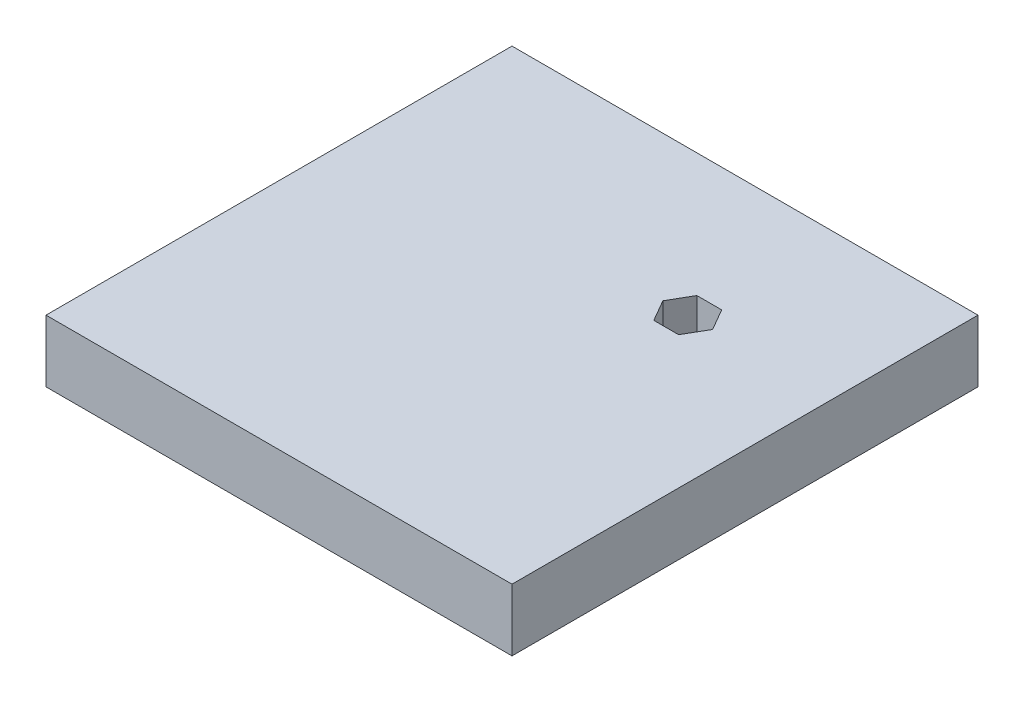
ISO-10303-21;
HEADER;
FILE_DESCRIPTION(('STEP AP214'),'2;1');
FILE_NAME('part.step','',(''),(''),'','','');
FILE_SCHEMA(('AUTOMOTIVE_DESIGN { 1 0 10303 214 1 1 1 1 }'));
ENDSEC;
DATA;
#1=APPLICATION_CONTEXT('core data for automotive mechanical design processes');
#2=APPLICATION_PROTOCOL_DEFINITION('international standard','automotive_design',2000,#1);
#3=PRODUCT_CONTEXT('',#1,'mechanical');
#4=PRODUCT('Part','Part','',(#3));
#5=PRODUCT_RELATED_PRODUCT_CATEGORY('part','',(#4));
#6=PRODUCT_DEFINITION_FORMATION('','',#4);
#7=PRODUCT_DEFINITION_CONTEXT('part definition',#1,'design');
#8=PRODUCT_DEFINITION('design','',#6,#7);
#9=PRODUCT_DEFINITION_SHAPE('','',#8);
#10=(LENGTH_UNIT() NAMED_UNIT(*) SI_UNIT(.MILLI.,.METRE.));
#11=(NAMED_UNIT(*) PLANE_ANGLE_UNIT() SI_UNIT($,.RADIAN.));
#12=(NAMED_UNIT(*) SI_UNIT($,.STERADIAN.) SOLID_ANGLE_UNIT());
#13=UNCERTAINTY_MEASURE_WITH_UNIT(LENGTH_MEASURE(1.E-05),#10,'distance_accuracy_value','');
#14=(GEOMETRIC_REPRESENTATION_CONTEXT(3) GLOBAL_UNCERTAINTY_ASSIGNED_CONTEXT((#13)) GLOBAL_UNIT_ASSIGNED_CONTEXT((#10,
#11,#12)) REPRESENTATION_CONTEXT('',''));
#15=CARTESIAN_POINT('',(0.,0.,0.));
#16=DIRECTION('',(0.,0.,1.));
#17=DIRECTION('',(1.,0.,0.));
#18=AXIS2_PLACEMENT_3D('',#15,#16,#17);
#19=CARTESIAN_POINT('',(-75.,20.,-75.));
#20=DIRECTION('',(1.,0.,0.));
#21=DIRECTION('',(0.,0.,-1.));
#22=AXIS2_PLACEMENT_3D('',#19,#20,#21);
#23=PLANE('',#22);
#24=DIRECTION('',(0.,0.,1.));
#25=VECTOR('',#24,1.);
#26=CARTESIAN_POINT('',(-75.,0.,-75.));
#27=LINE('',#26,#25);
#28=CARTESIAN_POINT('',(-75.,0.,-75.));
#29=VERTEX_POINT('',#28);
#30=CARTESIAN_POINT('',(-75.,0.,75.));
#31=VERTEX_POINT('',#30);
#32=EDGE_CURVE('E155',#29,#31,#27,.T.);
#33=ORIENTED_EDGE('',*,*,#32,.T.);
#34=DIRECTION('',(0.,-1.,0.));
#35=VECTOR('',#34,1.);
#36=CARTESIAN_POINT('',(-75.,20.,75.));
#37=LINE('',#36,#35);
#38=CARTESIAN_POINT('',(-75.,20.,75.));
#39=VERTEX_POINT('',#38);
#40=EDGE_CURVE('E11',#39,#31,#37,.T.);
#41=ORIENTED_EDGE('',*,*,#40,.F.);
#42=DIRECTION('',(0.,0.,1.));
#43=VECTOR('',#42,1.);
#44=CARTESIAN_POINT('',(-75.,20.,-75.));
#45=LINE('',#44,#43);
#46=CARTESIAN_POINT('',(-75.,20.,-75.));
#47=VERTEX_POINT('',#46);
#48=EDGE_CURVE('E170',#47,#39,#45,.T.);
#49=ORIENTED_EDGE('',*,*,#48,.F.);
#50=DIRECTION('',(0.,-1.,0.));
#51=VECTOR('',#50,1.);
#52=CARTESIAN_POINT('',(-75.,20.,-75.));
#53=LINE('',#52,#51);
#54=EDGE_CURVE('E179',#47,#29,#53,.T.);
#55=ORIENTED_EDGE('',*,*,#54,.T.);
#56=EDGE_LOOP('',(#33,#41,#49,#55));
#57=FACE_BOUND('',#56,.T.);
#58=ADVANCED_FACE('F32',(#57),#23,.F.);
#59=CARTESIAN_POINT('',(-75.,20.,75.));
#60=DIRECTION('',(0.,0.,-1.));
#61=DIRECTION('',(-1.,0.,0.));
#62=AXIS2_PLACEMENT_3D('',#59,#60,#61);
#63=PLANE('',#62);
#64=DIRECTION('',(1.,0.,0.));
#65=VECTOR('',#64,1.);
#66=CARTESIAN_POINT('',(-75.,0.,75.));
#67=LINE('',#66,#65);
#68=CARTESIAN_POINT('',(75.,0.,75.));
#69=VERTEX_POINT('',#68);
#70=EDGE_CURVE('E164',#31,#69,#67,.T.);
#71=ORIENTED_EDGE('',*,*,#70,.T.);
#72=DIRECTION('',(0.,-1.,0.));
#73=VECTOR('',#72,1.);
#74=CARTESIAN_POINT('',(75.,20.,75.));
#75=LINE('',#74,#73);
#76=CARTESIAN_POINT('',(75.,20.,75.));
#77=VERTEX_POINT('',#76);
#78=EDGE_CURVE('E39',#77,#69,#75,.T.);
#79=ORIENTED_EDGE('',*,*,#78,.F.);
#80=DIRECTION('',(1.,0.,0.));
#81=VECTOR('',#80,1.);
#82=CARTESIAN_POINT('',(-75.,20.,75.));
#83=LINE('',#82,#81);
#84=EDGE_CURVE('E173',#39,#77,#83,.T.);
#85=ORIENTED_EDGE('',*,*,#84,.F.);
#86=ORIENTED_EDGE('',*,*,#40,.T.);
#87=EDGE_LOOP('',(#71,#79,#85,#86));
#88=FACE_BOUND('',#87,.T.);
#89=ADVANCED_FACE('F203',(#88),#63,.F.);
#90=CARTESIAN_POINT('',(75.,20.,-75.));
#91=DIRECTION('',(-1.,0.,0.));
#92=DIRECTION('',(0.,0.,1.));
#93=AXIS2_PLACEMENT_3D('',#90,#91,#92);
#94=PLANE('',#93);
#95=DIRECTION('',(0.,0.,-1.));
#96=VECTOR('',#95,1.);
#97=CARTESIAN_POINT('',(75.,0.,-75.));
#98=LINE('',#97,#96);
#99=CARTESIAN_POINT('',(75.,0.,-75.));
#100=VERTEX_POINT('',#99);
#101=EDGE_CURVE('E166',#69,#100,#98,.T.);
#102=ORIENTED_EDGE('',*,*,#101,.T.);
#103=DIRECTION('',(0.,-1.,0.));
#104=VECTOR('',#103,1.);
#105=CARTESIAN_POINT('',(75.,20.,-75.));
#106=LINE('',#105,#104);
#107=CARTESIAN_POINT('',(75.,20.,-75.));
#108=VERTEX_POINT('',#107);
#109=EDGE_CURVE('E182',#108,#100,#106,.T.);
#110=ORIENTED_EDGE('',*,*,#109,.F.);
#111=DIRECTION('',(0.,0.,-1.));
#112=VECTOR('',#111,1.);
#113=CARTESIAN_POINT('',(75.,20.,-75.));
#114=LINE('',#113,#112);
#115=EDGE_CURVE('E175',#77,#108,#114,.T.);
#116=ORIENTED_EDGE('',*,*,#115,.F.);
#117=ORIENTED_EDGE('',*,*,#78,.T.);
#118=EDGE_LOOP('',(#102,#110,#116,#117));
#119=FACE_BOUND('',#118,.T.);
#120=ADVANCED_FACE('F189',(#119),#94,.F.);
#121=CARTESIAN_POINT('',(-75.,20.,-75.));
#122=DIRECTION('',(0.,0.,1.));
#123=DIRECTION('',(1.,0.,0.));
#124=AXIS2_PLACEMENT_3D('',#121,#122,#123);
#125=PLANE('',#124);
#126=DIRECTION('',(-1.,0.,0.));
#127=VECTOR('',#126,1.);
#128=CARTESIAN_POINT('',(-75.,0.,-75.));
#129=LINE('',#128,#127);
#130=EDGE_CURVE('E168',#100,#29,#129,.T.);
#131=ORIENTED_EDGE('',*,*,#130,.T.);
#132=ORIENTED_EDGE('',*,*,#54,.F.);
#133=DIRECTION('',(-1.,0.,0.));
#134=VECTOR('',#133,1.);
#135=CARTESIAN_POINT('',(-75.,20.,-75.));
#136=LINE('',#135,#134);
#137=EDGE_CURVE('E177',#108,#47,#136,.T.);
#138=ORIENTED_EDGE('',*,*,#137,.F.);
#139=ORIENTED_EDGE('',*,*,#109,.T.);
#140=EDGE_LOOP('',(#131,#132,#138,#139));
#141=FACE_BOUND('',#140,.T.);
#142=ADVANCED_FACE('F198',(#141),#125,.F.);
#143=CARTESIAN_POINT('',(-75.,20.,75.));
#144=DIRECTION('',(0.,1.,0.));
#145=DIRECTION('',(0.,0.,1.));
#146=AXIS2_PLACEMENT_3D('',#143,#144,#145);
#147=PLANE('',#146);
#148=DIRECTION('',(0.5,0.,-0.866025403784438));
#149=VECTOR('',#148,1.);
#150=CARTESIAN_POINT('',(32.2842712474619,20.,-21.3560680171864));
#151=LINE('',#150,#149);
#152=CARTESIAN_POINT('',(32.2842712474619,20.,-21.3560680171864));
#153=VERTEX_POINT('',#152);
#154=CARTESIAN_POINT('',(36.2842712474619,20.,-28.284271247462));
#155=VERTEX_POINT('',#154);
#156=EDGE_CURVE('E46',#153,#155,#151,.T.);
#157=ORIENTED_EDGE('',*,*,#156,.F.);
#158=DIRECTION('',(1.,0.,0.));
#159=VECTOR('',#158,1.);
#160=CARTESIAN_POINT('',(24.2842712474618,20.,-21.3560680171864));
#161=LINE('',#160,#159);
#162=CARTESIAN_POINT('',(24.2842712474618,20.,-21.3560680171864));
#163=VERTEX_POINT('',#162);
#164=EDGE_CURVE('E135',#163,#153,#161,.T.);
#165=ORIENTED_EDGE('',*,*,#164,.F.);
#166=DIRECTION('',(0.5,0.,0.866025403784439));
#167=VECTOR('',#166,1.);
#168=CARTESIAN_POINT('',(20.2842712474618,20.,-28.284271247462));
#169=LINE('',#168,#167);
#170=CARTESIAN_POINT('',(20.2842712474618,20.,-28.284271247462));
#171=VERTEX_POINT('',#170);
#172=EDGE_CURVE('E129',#171,#163,#169,.T.);
#173=ORIENTED_EDGE('',*,*,#172,.F.);
#174=DIRECTION('',(-0.5,0.,0.866025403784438));
#175=VECTOR('',#174,1.);
#176=CARTESIAN_POINT('',(24.2842712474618,20.,-35.2124744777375));
#177=LINE('',#176,#175);
#178=CARTESIAN_POINT('',(24.2842712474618,20.,-35.2124744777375));
#179=VERTEX_POINT('',#178);
#180=EDGE_CURVE('E127',#179,#171,#177,.T.);
#181=ORIENTED_EDGE('',*,*,#180,.F.);
#182=DIRECTION('',(-1.,0.,0.));
#183=VECTOR('',#182,1.);
#184=CARTESIAN_POINT('',(32.2842712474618,20.,-35.2124744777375));
#185=LINE('',#184,#183);
#186=CARTESIAN_POINT('',(32.2842712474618,20.,-35.2124744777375));
#187=VERTEX_POINT('',#186);
#188=EDGE_CURVE('E110',#187,#179,#185,.T.);
#189=ORIENTED_EDGE('',*,*,#188,.F.);
#190=DIRECTION('',(-0.5,0.,-0.866025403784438));
#191=VECTOR('',#190,1.);
#192=CARTESIAN_POINT('',(36.2842712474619,20.,-28.284271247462));
#193=LINE('',#192,#191);
#194=EDGE_CURVE('E119',#155,#187,#193,.T.);
#195=ORIENTED_EDGE('',*,*,#194,.F.);
#196=EDGE_LOOP('',(#157,#165,#173,#181,#189,#195));
#197=FACE_BOUND('',#196,.T.);
#198=ORIENTED_EDGE('',*,*,#48,.T.);
#199=ORIENTED_EDGE('',*,*,#84,.T.);
#200=ORIENTED_EDGE('',*,*,#115,.T.);
#201=ORIENTED_EDGE('',*,*,#137,.T.);
#202=EDGE_LOOP('',(#198,#199,#200,#201));
#203=FACE_BOUND('',#202,.T.);
#204=ADVANCED_FACE('F123',(#197,#203),#147,.T.);
#205=CARTESIAN_POINT('',(-75.,0.,75.));
#206=DIRECTION('',(0.,1.,0.));
#207=DIRECTION('',(0.,0.,1.));
#208=AXIS2_PLACEMENT_3D('',#205,#206,#207);
#209=PLANE('',#208);
#210=DIRECTION('',(1.,0.,0.));
#211=VECTOR('',#210,1.);
#212=CARTESIAN_POINT('',(24.2842712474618,0.,-21.3560680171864));
#213=LINE('',#212,#211);
#214=CARTESIAN_POINT('',(24.2842712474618,0.,-21.3560680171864));
#215=VERTEX_POINT('',#214);
#216=CARTESIAN_POINT('',(32.2842712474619,0.,-21.3560680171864));
#217=VERTEX_POINT('',#216);
#218=EDGE_CURVE('E150',#215,#217,#213,.T.);
#219=ORIENTED_EDGE('',*,*,#218,.T.);
#220=DIRECTION('',(0.5,0.,-0.866025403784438));
#221=VECTOR('',#220,1.);
#222=CARTESIAN_POINT('',(32.2842712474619,0.,-21.3560680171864));
#223=LINE('',#222,#221);
#224=CARTESIAN_POINT('',(36.2842712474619,0.,-28.284271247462));
#225=VERTEX_POINT('',#224);
#226=EDGE_CURVE('E138',#217,#225,#223,.T.);
#227=ORIENTED_EDGE('',*,*,#226,.T.);
#228=DIRECTION('',(-0.5,0.,-0.866025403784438));
#229=VECTOR('',#228,1.);
#230=CARTESIAN_POINT('',(36.2842712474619,0.,-28.284271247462));
#231=LINE('',#230,#229);
#232=CARTESIAN_POINT('',(32.2842712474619,0.,-35.2124744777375));
#233=VERTEX_POINT('',#232);
#234=EDGE_CURVE('E141',#225,#233,#231,.T.);
#235=ORIENTED_EDGE('',*,*,#234,.T.);
#236=DIRECTION('',(-1.,0.,0.));
#237=VECTOR('',#236,1.);
#238=CARTESIAN_POINT('',(32.2842712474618,0.,-35.2124744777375));
#239=LINE('',#238,#237);
#240=CARTESIAN_POINT('',(24.2842712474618,0.,-35.2124744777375));
#241=VERTEX_POINT('',#240);
#242=EDGE_CURVE('E54',#233,#241,#239,.T.);
#243=ORIENTED_EDGE('',*,*,#242,.T.);
#244=DIRECTION('',(-0.5,0.,0.866025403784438));
#245=VECTOR('',#244,1.);
#246=CARTESIAN_POINT('',(24.2842712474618,0.,-35.2124744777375));
#247=LINE('',#246,#245);
#248=CARTESIAN_POINT('',(20.2842712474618,0.,-28.284271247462));
#249=VERTEX_POINT('',#248);
#250=EDGE_CURVE('E144',#241,#249,#247,.T.);
#251=ORIENTED_EDGE('',*,*,#250,.T.);
#252=DIRECTION('',(0.5,0.,0.866025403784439));
#253=VECTOR('',#252,1.);
#254=CARTESIAN_POINT('',(20.2842712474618,0.,-28.284271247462));
#255=LINE('',#254,#253);
#256=EDGE_CURVE('E147',#249,#215,#255,.T.);
#257=ORIENTED_EDGE('',*,*,#256,.T.);
#258=EDGE_LOOP('',(#219,#227,#235,#243,#251,#257));
#259=FACE_BOUND('',#258,.T.);
#260=ORIENTED_EDGE('',*,*,#32,.F.);
#261=ORIENTED_EDGE('',*,*,#130,.F.);
#262=ORIENTED_EDGE('',*,*,#101,.F.);
#263=ORIENTED_EDGE('',*,*,#70,.F.);
#264=EDGE_LOOP('',(#260,#261,#262,#263));
#265=FACE_BOUND('',#264,.T.);
#266=ADVANCED_FACE('F195',(#259,#265),#209,.F.);
#267=CARTESIAN_POINT('',(32.2842712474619,0.,-21.3560680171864));
#268=DIRECTION('',(0.866025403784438,0.,0.5));
#269=DIRECTION('',(0.5,0.,-0.866025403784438));
#270=AXIS2_PLACEMENT_3D('',#267,#268,#269);
#271=PLANE('',#270);
#272=ORIENTED_EDGE('',*,*,#156,.T.);
#273=DIRECTION('',(0.,1.,0.));
#274=VECTOR('',#273,1.);
#275=CARTESIAN_POINT('',(36.2842712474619,0.,-28.284271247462));
#276=LINE('',#275,#274);
#277=EDGE_CURVE('E116',#225,#155,#276,.T.);
#278=ORIENTED_EDGE('',*,*,#277,.F.);
#279=ORIENTED_EDGE('',*,*,#226,.F.);
#280=DIRECTION('',(0.,1.,0.));
#281=VECTOR('',#280,1.);
#282=CARTESIAN_POINT('',(32.2842712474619,0.,-21.3560680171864));
#283=LINE('',#282,#281);
#284=EDGE_CURVE('E153',#217,#153,#283,.T.);
#285=ORIENTED_EDGE('',*,*,#284,.T.);
#286=EDGE_LOOP('',(#272,#278,#279,#285));
#287=FACE_BOUND('',#286,.T.);
#288=ADVANCED_FACE('F217',(#287),#271,.F.);
#289=CARTESIAN_POINT('',(24.2842712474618,0.,-21.3560680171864));
#290=DIRECTION('',(0.,0.,1.));
#291=DIRECTION('',(1.,0.,0.));
#292=AXIS2_PLACEMENT_3D('',#289,#290,#291);
#293=PLANE('',#292);
#294=ORIENTED_EDGE('',*,*,#164,.T.);
#295=ORIENTED_EDGE('',*,*,#284,.F.);
#296=ORIENTED_EDGE('',*,*,#218,.F.);
#297=DIRECTION('',(0.,1.,0.));
#298=VECTOR('',#297,1.);
#299=CARTESIAN_POINT('',(24.2842712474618,0.,-21.3560680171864));
#300=LINE('',#299,#298);
#301=EDGE_CURVE('E156',#215,#163,#300,.T.);
#302=ORIENTED_EDGE('',*,*,#301,.T.);
#303=EDGE_LOOP('',(#294,#295,#296,#302));
#304=FACE_BOUND('',#303,.T.);
#305=ADVANCED_FACE('F221',(#304),#293,.F.);
#306=CARTESIAN_POINT('',(20.2842712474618,0.,-28.284271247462));
#307=DIRECTION('',(-0.866025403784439,0.,0.5));
#308=DIRECTION('',(0.5,0.,0.866025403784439));
#309=AXIS2_PLACEMENT_3D('',#306,#307,#308);
#310=PLANE('',#309);
#311=ORIENTED_EDGE('',*,*,#172,.T.);
#312=ORIENTED_EDGE('',*,*,#301,.F.);
#313=ORIENTED_EDGE('',*,*,#256,.F.);
#314=DIRECTION('',(0.,1.,0.));
#315=VECTOR('',#314,1.);
#316=CARTESIAN_POINT('',(20.2842712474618,0.,-28.284271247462));
#317=LINE('',#316,#315);
#318=EDGE_CURVE('E158',#249,#171,#317,.T.);
#319=ORIENTED_EDGE('',*,*,#318,.T.);
#320=EDGE_LOOP('',(#311,#312,#313,#319));
#321=FACE_BOUND('',#320,.T.);
#322=ADVANCED_FACE('F229',(#321),#310,.F.);
#323=CARTESIAN_POINT('',(24.2842712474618,0.,-35.2124744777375));
#324=DIRECTION('',(-0.866025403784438,0.,-0.5));
#325=DIRECTION('',(-0.5,0.,0.866025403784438));
#326=AXIS2_PLACEMENT_3D('',#323,#324,#325);
#327=PLANE('',#326);
#328=ORIENTED_EDGE('',*,*,#180,.T.);
#329=ORIENTED_EDGE('',*,*,#318,.F.);
#330=ORIENTED_EDGE('',*,*,#250,.F.);
#331=DIRECTION('',(0.,1.,0.));
#332=VECTOR('',#331,1.);
#333=CARTESIAN_POINT('',(24.2842712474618,0.,-35.2124744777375));
#334=LINE('',#333,#332);
#335=EDGE_CURVE('E115',#241,#179,#334,.T.);
#336=ORIENTED_EDGE('',*,*,#335,.T.);
#337=EDGE_LOOP('',(#328,#329,#330,#336));
#338=FACE_BOUND('',#337,.T.);
#339=ADVANCED_FACE('F226',(#338),#327,.F.);
#340=CARTESIAN_POINT('',(32.2842712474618,0.,-35.2124744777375));
#341=DIRECTION('',(0.,0.,-1.));
#342=DIRECTION('',(0.,1.,0.));
#343=AXIS2_PLACEMENT_3D('',#340,#341,#342);
#344=PLANE('',#343);
#345=ORIENTED_EDGE('',*,*,#188,.T.);
#346=ORIENTED_EDGE('',*,*,#335,.F.);
#347=ORIENTED_EDGE('',*,*,#242,.F.);
#348=DIRECTION('',(0.,1.,0.));
#349=VECTOR('',#348,1.);
#350=CARTESIAN_POINT('',(32.2842712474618,0.,-35.2124744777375));
#351=LINE('',#350,#349);
#352=EDGE_CURVE('E106',#233,#187,#351,.T.);
#353=ORIENTED_EDGE('',*,*,#352,.T.);
#354=EDGE_LOOP('',(#345,#346,#347,#353));
#355=FACE_BOUND('',#354,.T.);
#356=ADVANCED_FACE('F108',(#355),#344,.F.);
#357=CARTESIAN_POINT('',(36.2842712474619,0.,-28.284271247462));
#358=DIRECTION('',(0.866025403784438,0.,-0.5));
#359=DIRECTION('',(-0.5,0.,-0.866025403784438));
#360=AXIS2_PLACEMENT_3D('',#357,#358,#359);
#361=PLANE('',#360);
#362=ORIENTED_EDGE('',*,*,#194,.T.);
#363=ORIENTED_EDGE('',*,*,#352,.F.);
#364=ORIENTED_EDGE('',*,*,#234,.F.);
#365=ORIENTED_EDGE('',*,*,#277,.T.);
#366=EDGE_LOOP('',(#362,#363,#364,#365));
#367=FACE_BOUND('',#366,.T.);
#368=ADVANCED_FACE('F120',(#367),#361,.F.);
#369=CLOSED_SHELL('',(#58,#89,#120,#142,#204,#266,#288,#305,#322,#339,#356,#368));
#370=MANIFOLD_SOLID_BREP('B2',#369);
#371=ADVANCED_BREP_SHAPE_REPRESENTATION('',(#18,#370),#14);
#372=SHAPE_DEFINITION_REPRESENTATION(#9,#371);
ENDSEC;
END-ISO-10303-21;
